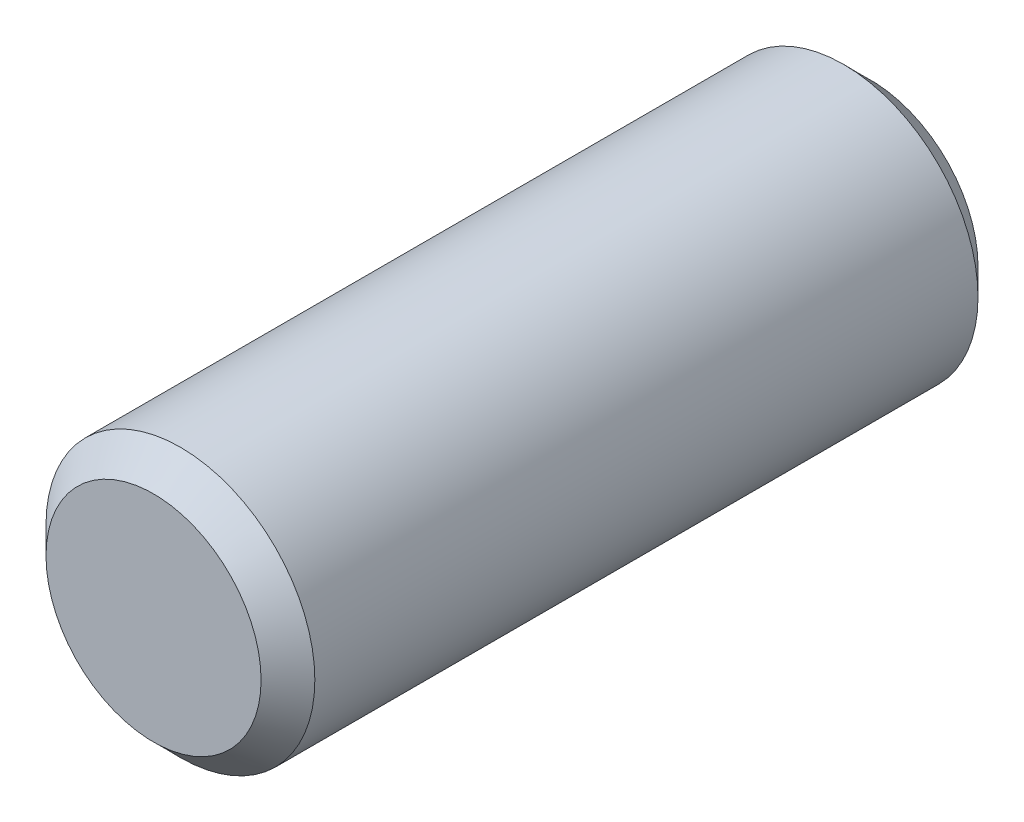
ISO-10303-21;
HEADER;
FILE_DESCRIPTION(('STEP AP214'),'2;1');
FILE_NAME('part.step','',(''),(''),'','','');
FILE_SCHEMA(('AUTOMOTIVE_DESIGN { 1 0 10303 214 1 1 1 1 }'));
ENDSEC;
DATA;
#1=APPLICATION_CONTEXT('core data for automotive mechanical design processes');
#2=APPLICATION_PROTOCOL_DEFINITION('international standard','automotive_design',2000,#1);
#3=PRODUCT_CONTEXT('',#1,'mechanical');
#4=PRODUCT('Part','Part','',(#3));
#5=PRODUCT_RELATED_PRODUCT_CATEGORY('part','',(#4));
#6=PRODUCT_DEFINITION_FORMATION('','',#4);
#7=PRODUCT_DEFINITION_CONTEXT('part definition',#1,'design');
#8=PRODUCT_DEFINITION('design','',#6,#7);
#9=PRODUCT_DEFINITION_SHAPE('','',#8);
#10=(LENGTH_UNIT() NAMED_UNIT(*) SI_UNIT(.MILLI.,.METRE.));
#11=(NAMED_UNIT(*) PLANE_ANGLE_UNIT() SI_UNIT($,.RADIAN.));
#12=(NAMED_UNIT(*) SI_UNIT($,.STERADIAN.) SOLID_ANGLE_UNIT());
#13=UNCERTAINTY_MEASURE_WITH_UNIT(LENGTH_MEASURE(1.E-05),#10,'distance_accuracy_value','');
#14=(GEOMETRIC_REPRESENTATION_CONTEXT(3) GLOBAL_UNCERTAINTY_ASSIGNED_CONTEXT((#13)) GLOBAL_UNIT_ASSIGNED_CONTEXT((#10,
#11,#12)) REPRESENTATION_CONTEXT('',''));
#15=CARTESIAN_POINT('',(0.,0.,0.));
#16=DIRECTION('',(0.,0.,1.));
#17=DIRECTION('',(1.,0.,0.));
#18=AXIS2_PLACEMENT_3D('',#15,#16,#17);
#19=CARTESIAN_POINT('',(0.,0.,8.));
#20=DIRECTION('',(0.,0.,-1.));
#21=DIRECTION('',(-1.,0.,0.));
#22=AXIS2_PLACEMENT_3D('',#19,#20,#21);
#23=CYLINDRICAL_SURFACE('',#22,1.5);
#24=CARTESIAN_POINT('',(0.,0.,0.3));
#25=DIRECTION('',(0.,0.,1.));
#26=DIRECTION('',(1.,0.,0.));
#27=AXIS2_PLACEMENT_3D('',#24,#25,#26);
#28=CIRCLE('',#27,1.5);
#29=CARTESIAN_POINT('',(1.5,0.,0.3));
#30=VERTEX_POINT('',#29);
#31=EDGE_CURVE('E142',#30,#30,#28,.T.);
#32=ORIENTED_EDGE('',*,*,#31,.T.);
#33=EDGE_LOOP('',(#32));
#34=FACE_BOUND('',#33,.T.);
#35=CARTESIAN_POINT('',(0.,0.,7.7));
#36=DIRECTION('',(0.,0.,1.));
#37=DIRECTION('',(1.,0.,0.));
#38=AXIS2_PLACEMENT_3D('',#35,#36,#37);
#39=CIRCLE('',#38,1.5);
#40=CARTESIAN_POINT('',(1.5,0.,7.7));
#41=VERTEX_POINT('',#40);
#42=EDGE_CURVE('E134',#41,#41,#39,.F.);
#43=ORIENTED_EDGE('',*,*,#42,.T.);
#44=EDGE_LOOP('',(#43));
#45=FACE_BOUND('',#44,.T.);
#46=ADVANCED_FACE('F32',(#34,#45),#23,.T.);
#47=CARTESIAN_POINT('',(0.,0.,8.));
#48=DIRECTION('',(0.,0.,1.));
#49=DIRECTION('',(1.,0.,0.));
#50=AXIS2_PLACEMENT_3D('',#47,#48,#49);
#51=PLANE('',#50);
#52=CARTESIAN_POINT('',(0.,0.,8.));
#53=DIRECTION('',(0.,0.,1.));
#54=DIRECTION('',(1.,0.,0.));
#55=AXIS2_PLACEMENT_3D('',#52,#53,#54);
#56=CIRCLE('',#55,1.2);
#57=CARTESIAN_POINT('',(1.2,0.,8.));
#58=VERTEX_POINT('',#57);
#59=EDGE_CURVE('E11',#58,#58,#56,.T.);
#60=ORIENTED_EDGE('',*,*,#59,.T.);
#61=EDGE_LOOP('',(#60));
#62=FACE_BOUND('',#61,.T.);
#63=ADVANCED_FACE('F156',(#62),#51,.T.);
#64=CARTESIAN_POINT('',(0.,0.,0.));
#65=DIRECTION('',(0.,0.,1.));
#66=DIRECTION('',(1.,0.,0.));
#67=AXIS2_PLACEMENT_3D('',#64,#65,#66);
#68=PLANE('',#67);
#69=DIRECTION('',(0.5,0.866025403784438,0.));
#70=VECTOR('',#69,1.);
#71=CARTESIAN_POINT('',(-1.15470053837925,0.,0.));
#72=LINE('',#71,#70);
#73=CARTESIAN_POINT('',(-1.15470053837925,0.,0.));
#74=VERTEX_POINT('',#73);
#75=CARTESIAN_POINT('',(-0.577350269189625,1.,0.));
#76=VERTEX_POINT('',#75);
#77=EDGE_CURVE('E121',#74,#76,#72,.T.);
#78=ORIENTED_EDGE('',*,*,#77,.F.);
#79=DIRECTION('',(-0.5,0.866025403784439,0.));
#80=VECTOR('',#79,1.);
#81=CARTESIAN_POINT('',(-0.577350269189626,-1.,0.));
#82=LINE('',#81,#80);
#83=CARTESIAN_POINT('',(-0.577350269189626,-1.,0.));
#84=VERTEX_POINT('',#83);
#85=EDGE_CURVE('E47',#84,#74,#82,.T.);
#86=ORIENTED_EDGE('',*,*,#85,.F.);
#87=DIRECTION('',(-1.,0.,0.));
#88=VECTOR('',#87,1.);
#89=CARTESIAN_POINT('',(0.577350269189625,-1.,0.));
#90=LINE('',#89,#88);
#91=CARTESIAN_POINT('',(0.577350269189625,-1.,0.));
#92=VERTEX_POINT('',#91);
#93=EDGE_CURVE('E130',#92,#84,#90,.T.);
#94=ORIENTED_EDGE('',*,*,#93,.F.);
#95=DIRECTION('',(-0.5,-0.866025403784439,0.));
#96=VECTOR('',#95,1.);
#97=CARTESIAN_POINT('',(1.15470053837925,0.,0.));
#98=LINE('',#97,#96);
#99=CARTESIAN_POINT('',(1.15470053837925,0.,0.));
#100=VERTEX_POINT('',#99);
#101=EDGE_CURVE('E128',#100,#92,#98,.T.);
#102=ORIENTED_EDGE('',*,*,#101,.F.);
#103=DIRECTION('',(0.5,-0.866025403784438,0.));
#104=VECTOR('',#103,1.);
#105=CARTESIAN_POINT('',(0.577350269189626,1.,0.));
#106=LINE('',#105,#104);
#107=CARTESIAN_POINT('',(0.577350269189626,1.,0.));
#108=VERTEX_POINT('',#107);
#109=EDGE_CURVE('E95',#108,#100,#106,.T.);
#110=ORIENTED_EDGE('',*,*,#109,.F.);
#111=DIRECTION('',(1.,0.,0.));
#112=VECTOR('',#111,1.);
#113=CARTESIAN_POINT('',(-0.577350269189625,1.,0.));
#114=LINE('',#113,#112);
#115=EDGE_CURVE('E124',#76,#108,#114,.T.);
#116=ORIENTED_EDGE('',*,*,#115,.F.);
#117=EDGE_LOOP('',(#78,#86,#94,#102,#110,#116));
#118=FACE_BOUND('',#117,.T.);
#119=CARTESIAN_POINT('',(0.,0.,0.));
#120=DIRECTION('',(0.,0.,1.));
#121=DIRECTION('',(1.,0.,0.));
#122=AXIS2_PLACEMENT_3D('',#119,#120,#121);
#123=CIRCLE('',#122,1.2);
#124=CARTESIAN_POINT('',(1.2,0.,0.));
#125=VERTEX_POINT('',#124);
#126=EDGE_CURVE('E40',#125,#125,#123,.F.);
#127=ORIENTED_EDGE('',*,*,#126,.T.);
#128=EDGE_LOOP('',(#127));
#129=FACE_BOUND('',#128,.T.);
#130=ADVANCED_FACE('F147',(#118,#129),#68,.F.);
#131=CARTESIAN_POINT('',(0.,0.,0.3));
#132=DIRECTION('',(0.,0.,1.));
#133=DIRECTION('',(1.,0.,0.));
#134=AXIS2_PLACEMENT_3D('',#131,#132,#133);
#135=CONICAL_SURFACE('',#134,1.5,0.78539816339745);
#136=ORIENTED_EDGE('',*,*,#126,.F.);
#137=EDGE_LOOP('',(#136));
#138=FACE_BOUND('',#137,.T.);
#139=ORIENTED_EDGE('',*,*,#31,.F.);
#140=EDGE_LOOP('',(#139));
#141=FACE_BOUND('',#140,.T.);
#142=ADVANCED_FACE('F149',(#138,#141),#135,.T.);
#143=CARTESIAN_POINT('',(0.,0.,8.));
#144=DIRECTION('',(0.,0.,-1.));
#145=DIRECTION('',(-1.,0.,0.));
#146=AXIS2_PLACEMENT_3D('',#143,#144,#145);
#147=CONICAL_SURFACE('',#146,1.2,0.785398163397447);
#148=ORIENTED_EDGE('',*,*,#42,.F.);
#149=EDGE_LOOP('',(#148));
#150=FACE_BOUND('',#149,.T.);
#151=ORIENTED_EDGE('',*,*,#59,.F.);
#152=EDGE_LOOP('',(#151));
#153=FACE_BOUND('',#152,.T.);
#154=ADVANCED_FACE('F34',(#150,#153),#147,.T.);
#155=CARTESIAN_POINT('',(-0.577350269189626,-1.,2.));
#156=DIRECTION('',(-0.866025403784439,-0.5,0.));
#157=DIRECTION('',(0.5,-0.866025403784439,0.));
#158=AXIS2_PLACEMENT_3D('',#155,#156,#157);
#159=PLANE('',#158);
#160=ORIENTED_EDGE('',*,*,#85,.T.);
#161=DIRECTION('',(0.,0.,-1.));
#162=VECTOR('',#161,1.);
#163=CARTESIAN_POINT('',(-1.15470053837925,0.,2.));
#164=LINE('',#163,#162);
#165=CARTESIAN_POINT('',(-1.15470053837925,0.,2.));
#166=VERTEX_POINT('',#165);
#167=EDGE_CURVE('E77',#166,#74,#164,.T.);
#168=ORIENTED_EDGE('',*,*,#167,.F.);
#169=DIRECTION('',(-0.5,0.866025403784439,0.));
#170=VECTOR('',#169,1.);
#171=CARTESIAN_POINT('',(-0.577350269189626,-1.,2.));
#172=LINE('',#171,#170);
#173=CARTESIAN_POINT('',(-0.577350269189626,-1.,2.));
#174=VERTEX_POINT('',#173);
#175=EDGE_CURVE('E132',#174,#166,#172,.T.);
#176=ORIENTED_EDGE('',*,*,#175,.F.);
#177=DIRECTION('',(0.,0.,-1.));
#178=VECTOR('',#177,1.);
#179=CARTESIAN_POINT('',(-0.577350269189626,-1.,2.));
#180=LINE('',#179,#178);
#181=EDGE_CURVE('E55',#174,#84,#180,.T.);
#182=ORIENTED_EDGE('',*,*,#181,.T.);
#183=EDGE_LOOP('',(#160,#168,#176,#182));
#184=FACE_BOUND('',#183,.T.);
#185=ADVANCED_FACE('F162',(#184),#159,.F.);
#186=CARTESIAN_POINT('',(0.577350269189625,-1.,2.));
#187=DIRECTION('',(0.,-1.,0.));
#188=DIRECTION('',(1.,0.,0.));
#189=AXIS2_PLACEMENT_3D('',#186,#187,#188);
#190=PLANE('',#189);
#191=ORIENTED_EDGE('',*,*,#93,.T.);
#192=ORIENTED_EDGE('',*,*,#181,.F.);
#193=DIRECTION('',(-1.,0.,0.));
#194=VECTOR('',#193,1.);
#195=CARTESIAN_POINT('',(0.577350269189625,-1.,2.));
#196=LINE('',#195,#194);
#197=CARTESIAN_POINT('',(0.577350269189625,-1.,2.));
#198=VERTEX_POINT('',#197);
#199=EDGE_CURVE('E107',#198,#174,#196,.T.);
#200=ORIENTED_EDGE('',*,*,#199,.F.);
#201=DIRECTION('',(0.,0.,-1.));
#202=VECTOR('',#201,1.);
#203=CARTESIAN_POINT('',(0.577350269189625,-1.,2.));
#204=LINE('',#203,#202);
#205=EDGE_CURVE('E99',#198,#92,#204,.T.);
#206=ORIENTED_EDGE('',*,*,#205,.T.);
#207=EDGE_LOOP('',(#191,#192,#200,#206));
#208=FACE_BOUND('',#207,.T.);
#209=ADVANCED_FACE('F175',(#208),#190,.F.);
#210=CARTESIAN_POINT('',(1.15470053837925,0.,2.));
#211=DIRECTION('',(0.866025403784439,-0.5,0.));
#212=DIRECTION('',(0.5,0.866025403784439,0.));
#213=AXIS2_PLACEMENT_3D('',#210,#211,#212);
#214=PLANE('',#213);
#215=ORIENTED_EDGE('',*,*,#101,.T.);
#216=ORIENTED_EDGE('',*,*,#205,.F.);
#217=DIRECTION('',(-0.5,-0.866025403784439,0.));
#218=VECTOR('',#217,1.);
#219=CARTESIAN_POINT('',(1.15470053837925,0.,2.));
#220=LINE('',#219,#218);
#221=CARTESIAN_POINT('',(1.15470053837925,0.,2.));
#222=VERTEX_POINT('',#221);
#223=EDGE_CURVE('E103',#222,#198,#220,.T.);
#224=ORIENTED_EDGE('',*,*,#223,.F.);
#225=DIRECTION('',(0.,0.,-1.));
#226=VECTOR('',#225,1.);
#227=CARTESIAN_POINT('',(1.15470053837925,0.,2.));
#228=LINE('',#227,#226);
#229=EDGE_CURVE('E88',#222,#100,#228,.T.);
#230=ORIENTED_EDGE('',*,*,#229,.T.);
#231=EDGE_LOOP('',(#215,#216,#224,#230));
#232=FACE_BOUND('',#231,.T.);
#233=ADVANCED_FACE('F104',(#232),#214,.F.);
#234=CARTESIAN_POINT('',(0.577350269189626,1.,2.));
#235=DIRECTION('',(0.866025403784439,0.5,0.));
#236=DIRECTION('',(-0.5,0.866025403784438,0.));
#237=AXIS2_PLACEMENT_3D('',#234,#235,#236);
#238=PLANE('',#237);
#239=ORIENTED_EDGE('',*,*,#109,.T.);
#240=ORIENTED_EDGE('',*,*,#229,.F.);
#241=DIRECTION('',(0.5,-0.866025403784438,0.));
#242=VECTOR('',#241,1.);
#243=CARTESIAN_POINT('',(0.577350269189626,1.,2.));
#244=LINE('',#243,#242);
#245=CARTESIAN_POINT('',(0.577350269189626,1.,2.));
#246=VERTEX_POINT('',#245);
#247=EDGE_CURVE('E92',#246,#222,#244,.T.);
#248=ORIENTED_EDGE('',*,*,#247,.F.);
#249=DIRECTION('',(0.,0.,-1.));
#250=VECTOR('',#249,1.);
#251=CARTESIAN_POINT('',(0.577350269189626,1.,2.));
#252=LINE('',#251,#250);
#253=EDGE_CURVE('E100',#246,#108,#252,.T.);
#254=ORIENTED_EDGE('',*,*,#253,.T.);
#255=EDGE_LOOP('',(#239,#240,#248,#254));
#256=FACE_BOUND('',#255,.T.);
#257=ADVANCED_FACE('F90',(#256),#238,.F.);
#258=CARTESIAN_POINT('',(-0.577350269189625,1.,2.));
#259=DIRECTION('',(0.,1.,0.));
#260=DIRECTION('',(0.,0.,1.));
#261=AXIS2_PLACEMENT_3D('',#258,#259,#260);
#262=PLANE('',#261);
#263=ORIENTED_EDGE('',*,*,#115,.T.);
#264=ORIENTED_EDGE('',*,*,#253,.F.);
#265=DIRECTION('',(1.,0.,0.));
#266=VECTOR('',#265,1.);
#267=CARTESIAN_POINT('',(-0.577350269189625,1.,2.));
#268=LINE('',#267,#266);
#269=CARTESIAN_POINT('',(-0.577350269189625,1.,2.));
#270=VERTEX_POINT('',#269);
#271=EDGE_CURVE('E113',#270,#246,#268,.T.);
#272=ORIENTED_EDGE('',*,*,#271,.F.);
#273=DIRECTION('',(0.,0.,-1.));
#274=VECTOR('',#273,1.);
#275=CARTESIAN_POINT('',(-0.577350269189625,1.,2.));
#276=LINE('',#275,#274);
#277=EDGE_CURVE('E137',#270,#76,#276,.T.);
#278=ORIENTED_EDGE('',*,*,#277,.T.);
#279=EDGE_LOOP('',(#263,#264,#272,#278));
#280=FACE_BOUND('',#279,.T.);
#281=ADVANCED_FACE('F179',(#280),#262,.F.);
#282=CARTESIAN_POINT('',(-1.15470053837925,0.,2.));
#283=DIRECTION('',(-0.866025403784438,0.5,0.));
#284=DIRECTION('',(-0.5,-0.866025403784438,0.));
#285=AXIS2_PLACEMENT_3D('',#282,#283,#284);
#286=PLANE('',#285);
#287=ORIENTED_EDGE('',*,*,#77,.T.);
#288=ORIENTED_EDGE('',*,*,#277,.F.);
#289=DIRECTION('',(0.5,0.866025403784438,0.));
#290=VECTOR('',#289,1.);
#291=CARTESIAN_POINT('',(-1.15470053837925,0.,2.));
#292=LINE('',#291,#290);
#293=EDGE_CURVE('E115',#166,#270,#292,.T.);
#294=ORIENTED_EDGE('',*,*,#293,.F.);
#295=ORIENTED_EDGE('',*,*,#167,.T.);
#296=EDGE_LOOP('',(#287,#288,#294,#295));
#297=FACE_BOUND('',#296,.T.);
#298=ADVANCED_FACE('F176',(#297),#286,.F.);
#299=CARTESIAN_POINT('',(-1.15470053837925,0.,2.));
#300=DIRECTION('',(0.,0.,-1.));
#301=DIRECTION('',(-1.,0.,0.));
#302=AXIS2_PLACEMENT_3D('',#299,#300,#301);
#303=PLANE('',#302);
#304=ORIENTED_EDGE('',*,*,#175,.T.);
#305=ORIENTED_EDGE('',*,*,#293,.T.);
#306=ORIENTED_EDGE('',*,*,#271,.T.);
#307=ORIENTED_EDGE('',*,*,#247,.T.);
#308=ORIENTED_EDGE('',*,*,#223,.T.);
#309=ORIENTED_EDGE('',*,*,#199,.T.);
#310=EDGE_LOOP('',(#304,#305,#306,#307,#308,#309));
#311=FACE_BOUND('',#310,.T.);
#312=ADVANCED_FACE('F110',(#311),#303,.T.);
#313=CLOSED_SHELL('',(#46,#63,#130,#142,#154,#185,#209,#233,#257,#281,#298,#312));
#314=MANIFOLD_SOLID_BREP('B2',#313);
#315=ADVANCED_BREP_SHAPE_REPRESENTATION('',(#18,#314),#14);
#316=SHAPE_DEFINITION_REPRESENTATION(#9,#315);
ENDSEC;
END-ISO-10303-21;
